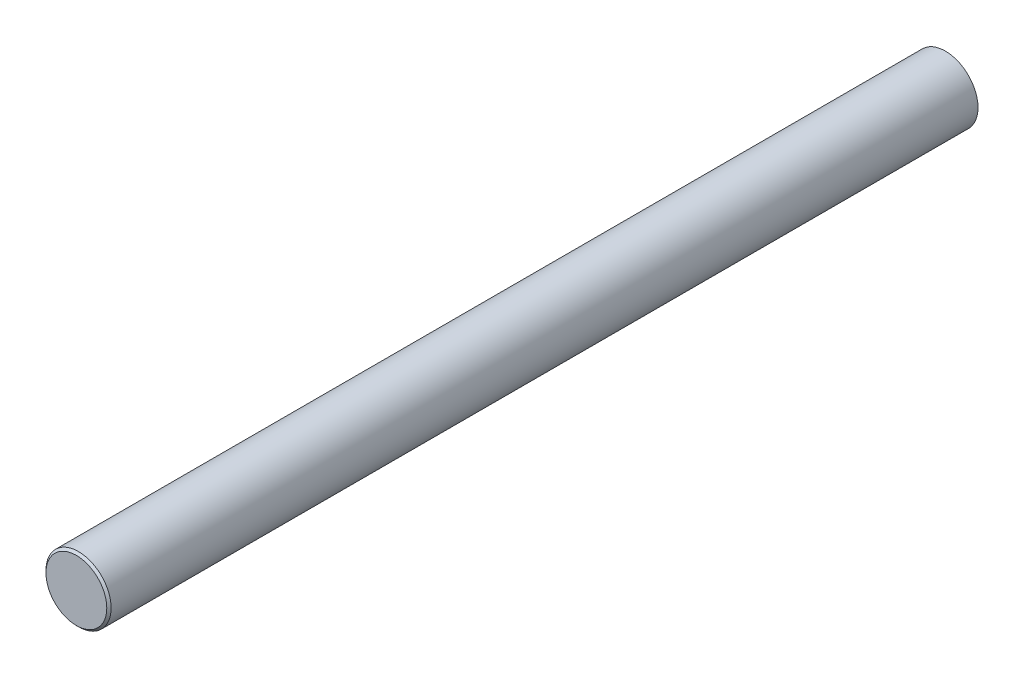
from build123d import *

# Parameters (mm, degrees)
ESQUISSE1_R          = 15
BASE_EXTRUSION_DEPTH = 400
CHANFREIN1_SIZE      = 1


with BuildPart() as part:
    # Esquisse1 → Base-Extrusion (new body)
    with BuildSketch(Plane.XY):
        Circle(ESQUISSE1_R)
    extrude(amount=BASE_EXTRUSION_DEPTH)

    # Chanfrein1
    chanfrein1_edges = [part.edges().sort_by_distance(p)[0] for p in [
        (-15, 0, 400),
    ]]
    chamfer(chanfrein1_edges, length=CHANFREIN1_SIZE)


solid = part.part
